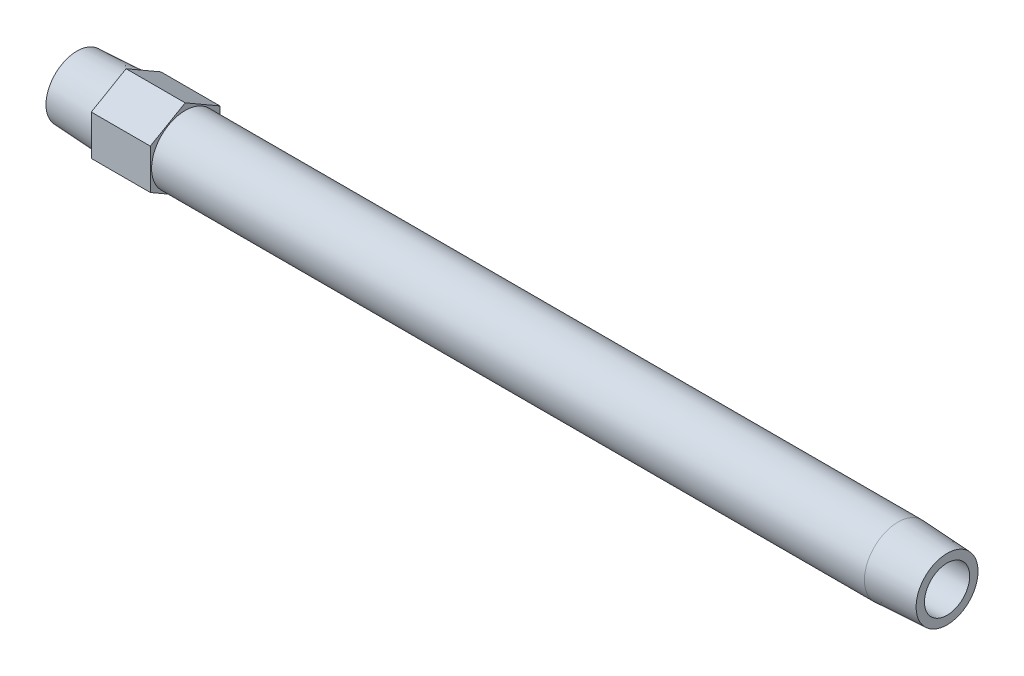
ISO-10303-21;
HEADER;
FILE_DESCRIPTION(('STEP AP214'),'2;1');
FILE_NAME('part.step','',(''),(''),'','','');
FILE_SCHEMA(('AUTOMOTIVE_DESIGN { 1 0 10303 214 1 1 1 1 }'));
ENDSEC;
DATA;
#1=APPLICATION_CONTEXT('core data for automotive mechanical design processes');
#2=APPLICATION_PROTOCOL_DEFINITION('international standard','automotive_design',2000,#1);
#3=PRODUCT_CONTEXT('',#1,'mechanical');
#4=PRODUCT('Part','Part','',(#3));
#5=PRODUCT_RELATED_PRODUCT_CATEGORY('part','',(#4));
#6=PRODUCT_DEFINITION_FORMATION('','',#4);
#7=PRODUCT_DEFINITION_CONTEXT('part definition',#1,'design');
#8=PRODUCT_DEFINITION('design','',#6,#7);
#9=PRODUCT_DEFINITION_SHAPE('','',#8);
#10=(LENGTH_UNIT() NAMED_UNIT(*) SI_UNIT(.MILLI.,.METRE.));
#11=(NAMED_UNIT(*) PLANE_ANGLE_UNIT() SI_UNIT($,.RADIAN.));
#12=(NAMED_UNIT(*) SI_UNIT($,.STERADIAN.) SOLID_ANGLE_UNIT());
#13=UNCERTAINTY_MEASURE_WITH_UNIT(LENGTH_MEASURE(1.E-05),#10,'distance_accuracy_value','');
#14=(GEOMETRIC_REPRESENTATION_CONTEXT(3) GLOBAL_UNCERTAINTY_ASSIGNED_CONTEXT((#13)) GLOBAL_UNIT_ASSIGNED_CONTEXT((#10,
#11,#12)) REPRESENTATION_CONTEXT('',''));
#15=CARTESIAN_POINT('',(0.,0.,0.));
#16=DIRECTION('',(0.,0.,1.));
#17=DIRECTION('',(1.,0.,0.));
#18=AXIS2_PLACEMENT_3D('',#15,#16,#17);
#19=CARTESIAN_POINT('',(0.,0.,-6.3321927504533));
#20=DIRECTION('',(1.,0.,0.));
#21=DIRECTION('',(0.,0.,-1.));
#22=AXIS2_PLACEMENT_3D('',#19,#20,#21);
#23=PLANE('',#22);
#24=CARTESIAN_POINT('',(0.,0.,0.));
#25=DIRECTION('',(-1.,0.,0.));
#26=DIRECTION('',(0.,0.,1.));
#27=AXIS2_PLACEMENT_3D('',#24,#25,#26);
#28=CIRCLE('',#27,6.3321927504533);
#29=CARTESIAN_POINT('',(0.,0.,6.3321927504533));
#30=VERTEX_POINT('',#29);
#31=EDGE_CURVE('E147',#30,#30,#28,.T.);
#32=ORIENTED_EDGE('',*,*,#31,.T.);
#33=EDGE_LOOP('',(#32));
#34=FACE_BOUND('',#33,.T.);
#35=CARTESIAN_POINT('',(0.,0.,0.));
#36=DIRECTION('',(1.,0.,0.));
#37=DIRECTION('',(0.,0.,1.));
#38=AXIS2_PLACEMENT_3D('',#35,#36,#37);
#39=CIRCLE('',#38,4.6228);
#40=CARTESIAN_POINT('',(0.,0.,4.6228));
#41=VERTEX_POINT('',#40);
#42=EDGE_CURVE('E159',#41,#41,#39,.T.);
#43=ORIENTED_EDGE('',*,*,#42,.T.);
#44=EDGE_LOOP('',(#43));
#45=FACE_BOUND('',#44,.T.);
#46=ADVANCED_FACE('F15',(#34,#45),#23,.F.);
#47=CARTESIAN_POINT('',(177.8,0.,-6.33219275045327));
#48=DIRECTION('',(-1.,0.,0.));
#49=DIRECTION('',(0.,0.,1.));
#50=AXIS2_PLACEMENT_3D('',#47,#48,#49);
#51=PLANE('',#50);
#52=CARTESIAN_POINT('',(177.8,0.,0.));
#53=DIRECTION('',(-1.,0.,0.));
#54=DIRECTION('',(0.,0.,1.));
#55=AXIS2_PLACEMENT_3D('',#52,#53,#54);
#56=CIRCLE('',#55,6.33219275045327);
#57=CARTESIAN_POINT('',(177.8,0.,6.33219275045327));
#58=VERTEX_POINT('',#57);
#59=EDGE_CURVE('E150',#58,#58,#56,.T.);
#60=ORIENTED_EDGE('',*,*,#59,.F.);
#61=EDGE_LOOP('',(#60));
#62=FACE_BOUND('',#61,.T.);
#63=CARTESIAN_POINT('',(177.8,0.,0.));
#64=DIRECTION('',(-1.,0.,0.));
#65=DIRECTION('',(0.,0.,1.));
#66=AXIS2_PLACEMENT_3D('',#63,#64,#65);
#67=CIRCLE('',#66,4.6228);
#68=CARTESIAN_POINT('',(177.8,0.,4.6228));
#69=VERTEX_POINT('',#68);
#70=EDGE_CURVE('E156',#69,#69,#67,.F.);
#71=ORIENTED_EDGE('',*,*,#70,.F.);
#72=EDGE_LOOP('',(#71));
#73=FACE_BOUND('',#72,.T.);
#74=ADVANCED_FACE('F178',(#62,#73),#51,.F.);
#75=CARTESIAN_POINT('',(22.098,-12.3183453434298,7.112));
#76=DIRECTION('',(-1.,0.,0.));
#77=DIRECTION('',(0.,-1.,0.));
#78=AXIS2_PLACEMENT_3D('',#75,#76,#77);
#79=PLANE('',#78);
#80=DIRECTION('',(0.,0.5,-0.866025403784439));
#81=VECTOR('',#80,1.);
#82=CARTESIAN_POINT('',(22.098,-8.21223022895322,0.));
#83=LINE('',#82,#81);
#84=CARTESIAN_POINT('',(22.098,-8.21223022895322,0.));
#85=VERTEX_POINT('',#84);
#86=CARTESIAN_POINT('',(22.098,-4.10611511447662,-7.112));
#87=VERTEX_POINT('',#86);
#88=EDGE_CURVE('E103',#85,#87,#83,.T.);
#89=ORIENTED_EDGE('',*,*,#88,.T.);
#90=DIRECTION('',(0.,1.,0.));
#91=VECTOR('',#90,1.);
#92=CARTESIAN_POINT('',(22.098,-4.10611511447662,-7.112));
#93=LINE('',#92,#91);
#94=CARTESIAN_POINT('',(22.098,4.10611511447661,-7.112));
#95=VERTEX_POINT('',#94);
#96=EDGE_CURVE('E83',#87,#95,#93,.T.);
#97=ORIENTED_EDGE('',*,*,#96,.T.);
#98=DIRECTION('',(0.,0.5,0.866025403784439));
#99=VECTOR('',#98,1.);
#100=CARTESIAN_POINT('',(22.098,4.10611511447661,-7.112));
#101=LINE('',#100,#99);
#102=CARTESIAN_POINT('',(22.098,8.21223022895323,0.));
#103=VERTEX_POINT('',#102);
#104=EDGE_CURVE('E102',#95,#103,#101,.T.);
#105=ORIENTED_EDGE('',*,*,#104,.T.);
#106=DIRECTION('',(0.,-0.5,0.866025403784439));
#107=VECTOR('',#106,1.);
#108=CARTESIAN_POINT('',(22.098,8.21223022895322,0.));
#109=LINE('',#108,#107);
#110=CARTESIAN_POINT('',(22.098,4.10611511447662,7.112));
#111=VERTEX_POINT('',#110);
#112=EDGE_CURVE('E105',#103,#111,#109,.T.);
#113=ORIENTED_EDGE('',*,*,#112,.T.);
#114=DIRECTION('',(0.,-1.,0.));
#115=VECTOR('',#114,1.);
#116=CARTESIAN_POINT('',(22.098,4.10611511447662,7.112));
#117=LINE('',#116,#115);
#118=CARTESIAN_POINT('',(22.098,-4.10611511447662,7.112));
#119=VERTEX_POINT('',#118);
#120=EDGE_CURVE('E35',#111,#119,#117,.T.);
#121=ORIENTED_EDGE('',*,*,#120,.T.);
#122=DIRECTION('',(0.,-0.5,-0.866025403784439));
#123=VECTOR('',#122,1.);
#124=CARTESIAN_POINT('',(22.098,-4.10611511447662,7.112));
#125=LINE('',#124,#123);
#126=EDGE_CURVE('E30',#119,#85,#125,.T.);
#127=ORIENTED_EDGE('',*,*,#126,.T.);
#128=EDGE_LOOP('',(#89,#97,#105,#113,#121,#127));
#129=FACE_BOUND('',#128,.T.);
#130=CARTESIAN_POINT('',(22.098,0.,0.));
#131=DIRECTION('',(-1.,0.,0.));
#132=DIRECTION('',(0.,-1.,0.));
#133=AXIS2_PLACEMENT_3D('',#130,#131,#132);
#134=CIRCLE('',#133,6.858);
#135=CARTESIAN_POINT('',(22.098,-6.858,0.));
#136=VERTEX_POINT('',#135);
#137=EDGE_CURVE('E89',#136,#136,#134,.F.);
#138=ORIENTED_EDGE('',*,*,#137,.F.);
#139=EDGE_LOOP('',(#138));
#140=FACE_BOUND('',#139,.T.);
#141=ADVANCED_FACE('F124',(#129,#140),#79,.F.);
#142=CARTESIAN_POINT('',(10.033,-12.3183453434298,7.112));
#143=DIRECTION('',(-1.,0.,0.));
#144=DIRECTION('',(0.,-1.,0.));
#145=AXIS2_PLACEMENT_3D('',#142,#143,#144);
#146=PLANE('',#145);
#147=DIRECTION('',(0.,0.5,-0.866025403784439));
#148=VECTOR('',#147,1.);
#149=CARTESIAN_POINT('',(10.033,-8.21223022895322,0.));
#150=LINE('',#149,#148);
#151=CARTESIAN_POINT('',(10.033,-8.21223022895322,0.));
#152=VERTEX_POINT('',#151);
#153=CARTESIAN_POINT('',(10.033,-4.10611511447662,-7.112));
#154=VERTEX_POINT('',#153);
#155=EDGE_CURVE('E73',#152,#154,#150,.T.);
#156=ORIENTED_EDGE('',*,*,#155,.F.);
#157=DIRECTION('',(0.,-0.5,-0.866025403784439));
#158=VECTOR('',#157,1.);
#159=CARTESIAN_POINT('',(10.033,-4.10611511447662,7.112));
#160=LINE('',#159,#158);
#161=CARTESIAN_POINT('',(10.033,-4.10611511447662,7.112));
#162=VERTEX_POINT('',#161);
#163=EDGE_CURVE('E99',#162,#152,#160,.T.);
#164=ORIENTED_EDGE('',*,*,#163,.F.);
#165=DIRECTION('',(0.,-1.,0.));
#166=VECTOR('',#165,1.);
#167=CARTESIAN_POINT('',(10.033,4.10611511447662,7.112));
#168=LINE('',#167,#166);
#169=CARTESIAN_POINT('',(10.033,4.10611511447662,7.112));
#170=VERTEX_POINT('',#169);
#171=EDGE_CURVE('E133',#170,#162,#168,.T.);
#172=ORIENTED_EDGE('',*,*,#171,.F.);
#173=DIRECTION('',(0.,-0.5,0.866025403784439));
#174=VECTOR('',#173,1.);
#175=CARTESIAN_POINT('',(10.033,8.21223022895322,0.));
#176=LINE('',#175,#174);
#177=CARTESIAN_POINT('',(10.033,8.21223022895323,0.));
#178=VERTEX_POINT('',#177);
#179=EDGE_CURVE('E129',#178,#170,#176,.T.);
#180=ORIENTED_EDGE('',*,*,#179,.F.);
#181=DIRECTION('',(0.,0.5,0.866025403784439));
#182=VECTOR('',#181,1.);
#183=CARTESIAN_POINT('',(10.033,4.10611511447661,-7.112));
#184=LINE('',#183,#182);
#185=CARTESIAN_POINT('',(10.033,4.10611511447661,-7.112));
#186=VERTEX_POINT('',#185);
#187=EDGE_CURVE('E75',#186,#178,#184,.T.);
#188=ORIENTED_EDGE('',*,*,#187,.F.);
#189=DIRECTION('',(0.,1.,0.));
#190=VECTOR('',#189,1.);
#191=CARTESIAN_POINT('',(10.033,-4.10611511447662,-7.112));
#192=LINE('',#191,#190);
#193=EDGE_CURVE('E68',#154,#186,#192,.T.);
#194=ORIENTED_EDGE('',*,*,#193,.F.);
#195=EDGE_LOOP('',(#156,#164,#172,#180,#188,#194));
#196=FACE_BOUND('',#195,.T.);
#197=CARTESIAN_POINT('',(10.033,0.,0.));
#198=DIRECTION('',(-1.,0.,0.));
#199=DIRECTION('',(0.,0.,1.));
#200=AXIS2_PLACEMENT_3D('',#197,#198,#199);
#201=CIRCLE('',#200,6.858);
#202=CARTESIAN_POINT('',(10.033,0.,6.858));
#203=VERTEX_POINT('',#202);
#204=EDGE_CURVE('E95',#203,#203,#201,.T.);
#205=ORIENTED_EDGE('',*,*,#204,.F.);
#206=EDGE_LOOP('',(#205));
#207=FACE_BOUND('',#206,.T.);
#208=ADVANCED_FACE('F69',(#196,#207),#146,.T.);
#209=CARTESIAN_POINT('',(22.098,-8.21223022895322,0.));
#210=DIRECTION('',(0.,0.866025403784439,0.5));
#211=DIRECTION('',(0.,-0.5,0.866025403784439));
#212=AXIS2_PLACEMENT_3D('',#209,#210,#211);
#213=PLANE('',#212);
#214=ORIENTED_EDGE('',*,*,#155,.T.);
#215=DIRECTION('',(-1.,0.,0.));
#216=VECTOR('',#215,1.);
#217=CARTESIAN_POINT('',(22.098,-4.10611511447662,-7.112));
#218=LINE('',#217,#216);
#219=EDGE_CURVE('E10',#87,#154,#218,.T.);
#220=ORIENTED_EDGE('',*,*,#219,.F.);
#221=ORIENTED_EDGE('',*,*,#88,.F.);
#222=DIRECTION('',(-1.,0.,0.));
#223=VECTOR('',#222,1.);
#224=CARTESIAN_POINT('',(22.098,-8.21223022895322,0.));
#225=LINE('',#224,#223);
#226=EDGE_CURVE('E87',#85,#152,#225,.T.);
#227=ORIENTED_EDGE('',*,*,#226,.T.);
#228=EDGE_LOOP('',(#214,#220,#221,#227));
#229=FACE_BOUND('',#228,.T.);
#230=ADVANCED_FACE('F17',(#229),#213,.F.);
#231=CARTESIAN_POINT('',(22.098,-4.10611511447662,-7.112));
#232=DIRECTION('',(0.,0.,1.));
#233=DIRECTION('',(0.,-1.,0.));
#234=AXIS2_PLACEMENT_3D('',#231,#232,#233);
#235=PLANE('',#234);
#236=ORIENTED_EDGE('',*,*,#193,.T.);
#237=DIRECTION('',(-1.,0.,0.));
#238=VECTOR('',#237,1.);
#239=CARTESIAN_POINT('',(22.098,4.10611511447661,-7.112));
#240=LINE('',#239,#238);
#241=EDGE_CURVE('E23',#95,#186,#240,.T.);
#242=ORIENTED_EDGE('',*,*,#241,.F.);
#243=ORIENTED_EDGE('',*,*,#96,.F.);
#244=ORIENTED_EDGE('',*,*,#219,.T.);
#245=EDGE_LOOP('',(#236,#242,#243,#244));
#246=FACE_BOUND('',#245,.T.);
#247=ADVANCED_FACE('F82',(#246),#235,.F.);
#248=CARTESIAN_POINT('',(22.098,4.10611511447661,-7.112));
#249=DIRECTION('',(0.,-0.866025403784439,0.5));
#250=DIRECTION('',(0.,-0.5,-0.866025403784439));
#251=AXIS2_PLACEMENT_3D('',#248,#249,#250);
#252=PLANE('',#251);
#253=ORIENTED_EDGE('',*,*,#187,.T.);
#254=DIRECTION('',(-1.,0.,0.));
#255=VECTOR('',#254,1.);
#256=CARTESIAN_POINT('',(22.098,8.21223022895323,0.));
#257=LINE('',#256,#255);
#258=EDGE_CURVE('E117',#103,#178,#257,.T.);
#259=ORIENTED_EDGE('',*,*,#258,.F.);
#260=ORIENTED_EDGE('',*,*,#104,.F.);
#261=ORIENTED_EDGE('',*,*,#241,.T.);
#262=EDGE_LOOP('',(#253,#259,#260,#261));
#263=FACE_BOUND('',#262,.T.);
#264=ADVANCED_FACE('F121',(#263),#252,.F.);
#265=CARTESIAN_POINT('',(22.098,8.21223022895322,0.));
#266=DIRECTION('',(0.,-0.866025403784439,-0.5));
#267=DIRECTION('',(0.,0.5,-0.866025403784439));
#268=AXIS2_PLACEMENT_3D('',#265,#266,#267);
#269=PLANE('',#268);
#270=ORIENTED_EDGE('',*,*,#179,.T.);
#271=DIRECTION('',(-1.,0.,0.));
#272=VECTOR('',#271,1.);
#273=CARTESIAN_POINT('',(22.098,4.10611511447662,7.112));
#274=LINE('',#273,#272);
#275=EDGE_CURVE('E114',#111,#170,#274,.T.);
#276=ORIENTED_EDGE('',*,*,#275,.F.);
#277=ORIENTED_EDGE('',*,*,#112,.F.);
#278=ORIENTED_EDGE('',*,*,#258,.T.);
#279=EDGE_LOOP('',(#270,#276,#277,#278));
#280=FACE_BOUND('',#279,.T.);
#281=ADVANCED_FACE('F128',(#280),#269,.F.);
#282=CARTESIAN_POINT('',(22.098,4.10611511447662,7.112));
#283=DIRECTION('',(0.,0.,-1.));
#284=DIRECTION('',(-1.,0.,0.));
#285=AXIS2_PLACEMENT_3D('',#282,#283,#284);
#286=PLANE('',#285);
#287=ORIENTED_EDGE('',*,*,#171,.T.);
#288=DIRECTION('',(-1.,0.,0.));
#289=VECTOR('',#288,1.);
#290=CARTESIAN_POINT('',(22.098,-4.10611511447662,7.112));
#291=LINE('',#290,#289);
#292=EDGE_CURVE('E111',#119,#162,#291,.T.);
#293=ORIENTED_EDGE('',*,*,#292,.F.);
#294=ORIENTED_EDGE('',*,*,#120,.F.);
#295=ORIENTED_EDGE('',*,*,#275,.T.);
#296=EDGE_LOOP('',(#287,#293,#294,#295));
#297=FACE_BOUND('',#296,.T.);
#298=ADVANCED_FACE('F132',(#297),#286,.F.);
#299=CARTESIAN_POINT('',(22.098,-4.10611511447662,7.112));
#300=DIRECTION('',(0.,0.866025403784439,-0.5));
#301=DIRECTION('',(0.,0.5,0.866025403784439));
#302=AXIS2_PLACEMENT_3D('',#299,#300,#301);
#303=PLANE('',#302);
#304=ORIENTED_EDGE('',*,*,#163,.T.);
#305=ORIENTED_EDGE('',*,*,#226,.F.);
#306=ORIENTED_EDGE('',*,*,#126,.F.);
#307=ORIENTED_EDGE('',*,*,#292,.T.);
#308=EDGE_LOOP('',(#304,#305,#306,#307));
#309=FACE_BOUND('',#308,.T.);
#310=ADVANCED_FACE('F135',(#309),#303,.F.);
#311=CARTESIAN_POINT('',(10.033,0.,0.));
#312=DIRECTION('',(1.,0.,0.));
#313=DIRECTION('',(0.,0.,-1.));
#314=AXIS2_PLACEMENT_3D('',#311,#312,#313);
#315=CONICAL_SURFACE('',#314,6.858,0.0523598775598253);
#316=ORIENTED_EDGE('',*,*,#31,.F.);
#317=EDGE_LOOP('',(#316));
#318=FACE_BOUND('',#317,.T.);
#319=ORIENTED_EDGE('',*,*,#204,.T.);
#320=EDGE_LOOP('',(#319));
#321=FACE_BOUND('',#320,.T.);
#322=ADVANCED_FACE('F187',(#318,#321),#315,.T.);
#323=CARTESIAN_POINT('',(-60.,0.,0.));
#324=DIRECTION('',(-1.,0.,0.));
#325=DIRECTION('',(0.,0.,1.));
#326=AXIS2_PLACEMENT_3D('',#323,#324,#325);
#327=CYLINDRICAL_SURFACE('',#326,6.858);
#328=ORIENTED_EDGE('',*,*,#137,.T.);
#329=EDGE_LOOP('',(#328));
#330=FACE_BOUND('',#329,.T.);
#331=CARTESIAN_POINT('',(167.767,0.,0.));
#332=DIRECTION('',(-1.,0.,0.));
#333=DIRECTION('',(0.,0.,1.));
#334=AXIS2_PLACEMENT_3D('',#331,#332,#333);
#335=CIRCLE('',#334,6.858);
#336=CARTESIAN_POINT('',(167.767,0.,6.858));
#337=VERTEX_POINT('',#336);
#338=EDGE_CURVE('E153',#337,#337,#335,.T.);
#339=ORIENTED_EDGE('',*,*,#338,.T.);
#340=EDGE_LOOP('',(#339));
#341=FACE_BOUND('',#340,.T.);
#342=ADVANCED_FACE('F174',(#330,#341),#327,.T.);
#343=CARTESIAN_POINT('',(177.8,0.,0.));
#344=DIRECTION('',(-1.,0.,0.));
#345=DIRECTION('',(0.,0.,1.));
#346=AXIS2_PLACEMENT_3D('',#343,#344,#345);
#347=CONICAL_SURFACE('',#346,6.33219275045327,0.0523598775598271);
#348=ORIENTED_EDGE('',*,*,#338,.F.);
#349=EDGE_LOOP('',(#348));
#350=FACE_BOUND('',#349,.T.);
#351=ORIENTED_EDGE('',*,*,#59,.T.);
#352=EDGE_LOOP('',(#351));
#353=FACE_BOUND('',#352,.T.);
#354=ADVANCED_FACE('F167',(#350,#353),#347,.T.);
#355=CARTESIAN_POINT('',(179.122653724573,0.,0.));
#356=DIRECTION('',(-1.,0.,0.));
#357=DIRECTION('',(0.,0.,1.));
#358=AXIS2_PLACEMENT_3D('',#355,#356,#357);
#359=CYLINDRICAL_SURFACE('',#358,4.6228);
#360=ORIENTED_EDGE('',*,*,#70,.T.);
#361=EDGE_LOOP('',(#360));
#362=FACE_BOUND('',#361,.T.);
#363=ORIENTED_EDGE('',*,*,#42,.F.);
#364=EDGE_LOOP('',(#363));
#365=FACE_BOUND('',#364,.T.);
#366=ADVANCED_FACE('F165',(#362,#365),#359,.F.);
#367=CLOSED_SHELL('',(#46,#74,#141,#208,#230,#247,#264,#281,#298,#310,#322,#342,#354,#366));
#368=MANIFOLD_SOLID_BREP('B1',#367);
#369=ADVANCED_BREP_SHAPE_REPRESENTATION('',(#18,#368),#14);
#370=SHAPE_DEFINITION_REPRESENTATION(#9,#369);
ENDSEC;
END-ISO-10303-21;
